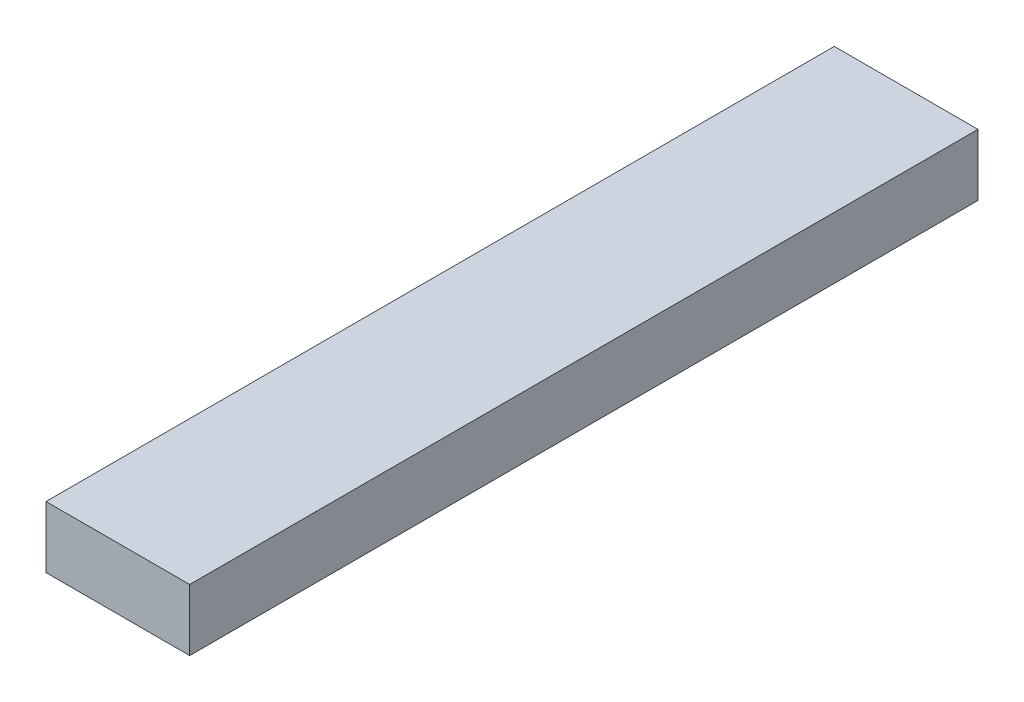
from build123d import *

# Parameters (mm, degrees)
SKETCH1_W           = 15
SKETCH1_H           = 192
BOSS_EXTRUDE1_DEPTH = 35


with BuildPart() as part:
    # Sketch1 → Boss-Extrude1 (new body)
    with BuildSketch(Plane.YZ):
        Rectangle(SKETCH1_W, SKETCH1_H)
    extrude(amount=BOSS_EXTRUDE1_DEPTH)


solid = part.part
